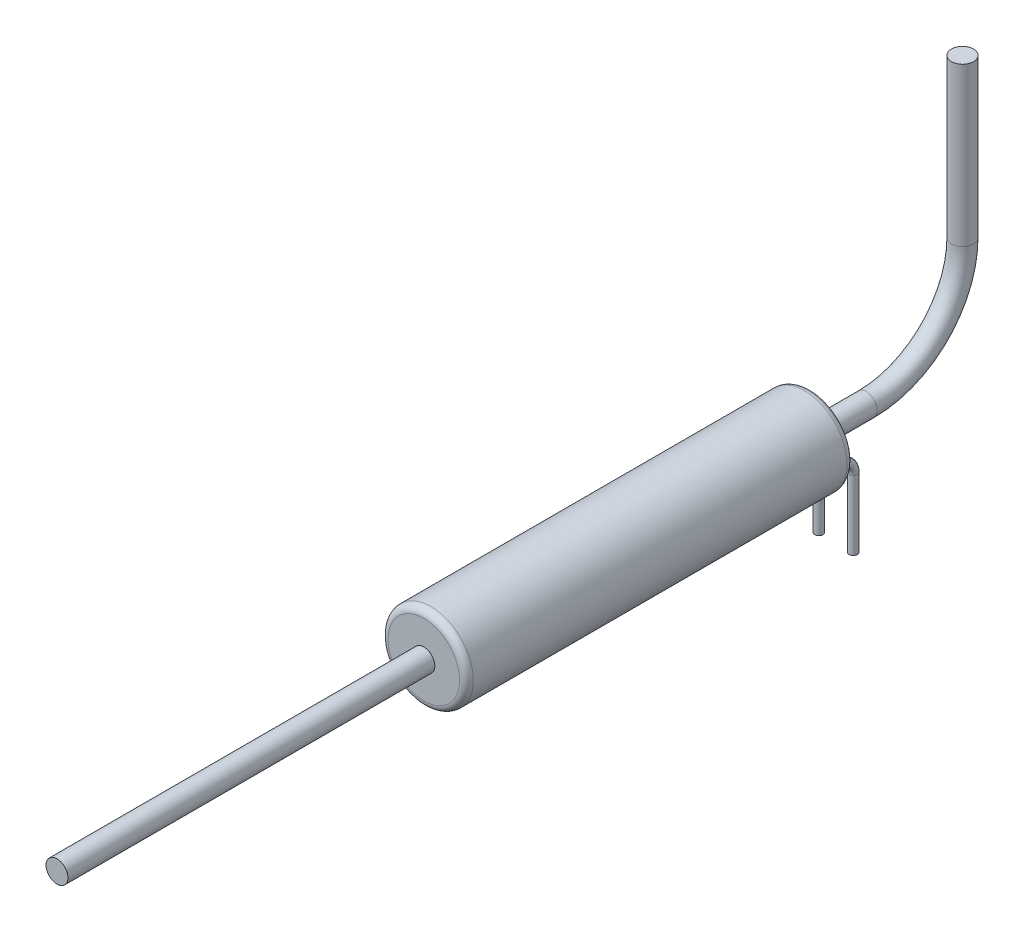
ISO-10303-21;
HEADER;
FILE_DESCRIPTION(('STEP AP214'),'2;1');
FILE_NAME('part.step','',(''),(''),'','','');
FILE_SCHEMA(('AUTOMOTIVE_DESIGN { 1 0 10303 214 1 1 1 1 }'));
ENDSEC;
DATA;
#1=APPLICATION_CONTEXT('core data for automotive mechanical design processes');
#2=APPLICATION_PROTOCOL_DEFINITION('international standard','automotive_design',2000,#1);
#3=PRODUCT_CONTEXT('',#1,'mechanical');
#4=PRODUCT('Part','Part','',(#3));
#5=PRODUCT_RELATED_PRODUCT_CATEGORY('part','',(#4));
#6=PRODUCT_DEFINITION_FORMATION('','',#4);
#7=PRODUCT_DEFINITION_CONTEXT('part definition',#1,'design');
#8=PRODUCT_DEFINITION('design','',#6,#7);
#9=PRODUCT_DEFINITION_SHAPE('','',#8);
#10=(LENGTH_UNIT() NAMED_UNIT(*) SI_UNIT(.MILLI.,.METRE.));
#11=(NAMED_UNIT(*) PLANE_ANGLE_UNIT() SI_UNIT($,.RADIAN.));
#12=(NAMED_UNIT(*) SI_UNIT($,.STERADIAN.) SOLID_ANGLE_UNIT());
#13=UNCERTAINTY_MEASURE_WITH_UNIT(LENGTH_MEASURE(1.E-05),#10,'distance_accuracy_value','');
#14=(GEOMETRIC_REPRESENTATION_CONTEXT(3) GLOBAL_UNCERTAINTY_ASSIGNED_CONTEXT((#13)) GLOBAL_UNIT_ASSIGNED_CONTEXT((#10,
#11,#12)) REPRESENTATION_CONTEXT('',''));
#15=CARTESIAN_POINT('',(0.,0.,0.));
#16=DIRECTION('',(0.,0.,1.));
#17=DIRECTION('',(1.,0.,0.));
#18=AXIS2_PLACEMENT_3D('',#15,#16,#17);
#19=CARTESIAN_POINT('',(0.,0.,28.2));
#20=DIRECTION('',(0.,0.,1.));
#21=DIRECTION('',(1.,0.,0.));
#22=AXIS2_PLACEMENT_3D('',#19,#20,#21);
#23=PLANE('',#22);
#24=CARTESIAN_POINT('',(0.,0.,28.2));
#25=DIRECTION('',(0.,0.,1.));
#26=DIRECTION('',(1.,0.,0.));
#27=AXIS2_PLACEMENT_3D('',#24,#25,#26);
#28=CIRCLE('',#27,2.6);
#29=CARTESIAN_POINT('',(2.6,0.,28.2));
#30=VERTEX_POINT('',#29);
#31=EDGE_CURVE('E12',#30,#30,#28,.T.);
#32=ORIENTED_EDGE('',*,*,#31,.T.);
#33=EDGE_LOOP('',(#32));
#34=FACE_BOUND('',#33,.T.);
#35=CARTESIAN_POINT('',(0.,0.,28.2));
#36=DIRECTION('',(0.,0.,1.));
#37=DIRECTION('',(1.,0.,0.));
#38=AXIS2_PLACEMENT_3D('',#35,#36,#37);
#39=CIRCLE('',#38,0.8);
#40=CARTESIAN_POINT('',(0.8,0.,28.2));
#41=VERTEX_POINT('',#40);
#42=EDGE_CURVE('E210',#41,#41,#39,.T.);
#43=ORIENTED_EDGE('',*,*,#42,.F.);
#44=EDGE_LOOP('',(#43));
#45=FACE_BOUND('',#44,.T.);
#46=ADVANCED_FACE('F46',(#34,#45),#23,.T.);
#47=CARTESIAN_POINT('',(0.,0.,0.));
#48=DIRECTION('',(0.,0.,1.));
#49=DIRECTION('',(1.,0.,0.));
#50=AXIS2_PLACEMENT_3D('',#47,#48,#49);
#51=PLANE('',#50);
#52=CARTESIAN_POINT('',(0.,0.,0.));
#53=DIRECTION('',(0.,0.,1.));
#54=DIRECTION('',(1.,0.,0.));
#55=AXIS2_PLACEMENT_3D('',#52,#53,#54);
#56=CIRCLE('',#55,2.6);
#57=CARTESIAN_POINT('',(2.6,0.,0.));
#58=VERTEX_POINT('',#57);
#59=EDGE_CURVE('E61',#58,#58,#56,.F.);
#60=ORIENTED_EDGE('',*,*,#59,.T.);
#61=EDGE_LOOP('',(#60));
#62=FACE_BOUND('',#61,.T.);
#63=CARTESIAN_POINT('',(-1.25,-1.55,0.));
#64=DIRECTION('',(0.,0.,1.));
#65=DIRECTION('',(1.,0.,0.));
#66=AXIS2_PLACEMENT_3D('',#63,#64,#65);
#67=CIRCLE('',#66,0.3);
#68=CARTESIAN_POINT('',(-0.95,-1.55,0.));
#69=VERTEX_POINT('',#68);
#70=EDGE_CURVE('E116',#69,#69,#67,.F.);
#71=ORIENTED_EDGE('',*,*,#70,.F.);
#72=EDGE_LOOP('',(#71));
#73=FACE_BOUND('',#72,.T.);
#74=CARTESIAN_POINT('',(1.25,-1.55,0.));
#75=DIRECTION('',(0.,0.,-1.));
#76=DIRECTION('',(-1.,0.,0.));
#77=AXIS2_PLACEMENT_3D('',#74,#75,#76);
#78=CIRCLE('',#77,0.3);
#79=CARTESIAN_POINT('',(0.95,-1.55,0.));
#80=VERTEX_POINT('',#79);
#81=EDGE_CURVE('E120',#80,#80,#78,.T.);
#82=ORIENTED_EDGE('',*,*,#81,.F.);
#83=EDGE_LOOP('',(#82));
#84=FACE_BOUND('',#83,.T.);
#85=CARTESIAN_POINT('',(0.,0.,0.));
#86=DIRECTION('',(0.,0.,-1.));
#87=DIRECTION('',(0.,1.,0.));
#88=AXIS2_PLACEMENT_3D('',#85,#86,#87);
#89=CIRCLE('',#88,0.8);
#90=CARTESIAN_POINT('',(0.,0.8,0.));
#91=VERTEX_POINT('',#90);
#92=EDGE_CURVE('E66',#91,#91,#89,.T.);
#93=ORIENTED_EDGE('',*,*,#92,.F.);
#94=EDGE_LOOP('',(#93));
#95=FACE_BOUND('',#94,.T.);
#96=ADVANCED_FACE('F91',(#62,#73,#84,#95),#51,.F.);
#97=CARTESIAN_POINT('',(0.,0.,0.));
#98=DIRECTION('',(0.,0.,1.));
#99=DIRECTION('',(1.,0.,0.));
#100=AXIS2_PLACEMENT_3D('',#97,#98,#99);
#101=CYLINDRICAL_SURFACE('',#100,3.1);
#102=CARTESIAN_POINT('',(0.,0.,0.5));
#103=DIRECTION('',(0.,0.,1.));
#104=DIRECTION('',(1.,0.,0.));
#105=AXIS2_PLACEMENT_3D('',#102,#103,#104);
#106=CIRCLE('',#105,3.1);
#107=CARTESIAN_POINT('',(3.1,0.,0.5));
#108=VERTEX_POINT('',#107);
#109=EDGE_CURVE('E53',#108,#108,#106,.T.);
#110=ORIENTED_EDGE('',*,*,#109,.T.);
#111=EDGE_LOOP('',(#110));
#112=FACE_BOUND('',#111,.T.);
#113=CARTESIAN_POINT('',(0.,0.,27.7));
#114=DIRECTION('',(0.,0.,1.));
#115=DIRECTION('',(1.,0.,0.));
#116=AXIS2_PLACEMENT_3D('',#113,#114,#115);
#117=CIRCLE('',#116,3.1);
#118=CARTESIAN_POINT('',(3.1,0.,27.7));
#119=VERTEX_POINT('',#118);
#120=EDGE_CURVE('E57',#119,#119,#117,.F.);
#121=ORIENTED_EDGE('',*,*,#120,.T.);
#122=EDGE_LOOP('',(#121));
#123=FACE_BOUND('',#122,.T.);
#124=ADVANCED_FACE('F89',(#112,#123),#101,.T.);
#125=CARTESIAN_POINT('',(0.,0.,0.));
#126=DIRECTION('',(0.,0.,-1.));
#127=DIRECTION('',(0.,1.,0.));
#128=AXIS2_PLACEMENT_3D('',#125,#126,#127);
#129=CYLINDRICAL_SURFACE('',#128,0.8);
#130=ORIENTED_EDGE('',*,*,#92,.T.);
#131=EDGE_LOOP('',(#130));
#132=FACE_BOUND('',#131,.T.);
#133=CARTESIAN_POINT('',(0.,0.,-4.));
#134=DIRECTION('',(0.,0.,-1.));
#135=DIRECTION('',(0.,-1.,0.));
#136=AXIS2_PLACEMENT_3D('',#133,#134,#135);
#137=CIRCLE('',#136,0.8);
#138=CARTESIAN_POINT('',(0.,-0.799999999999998,-4.));
#139=VERTEX_POINT('',#138);
#140=EDGE_CURVE('E70',#139,#139,#137,.T.);
#141=ORIENTED_EDGE('',*,*,#140,.F.);
#142=EDGE_LOOP('',(#141));
#143=FACE_BOUND('',#142,.T.);
#144=ADVANCED_FACE('F84',(#132,#143),#129,.T.);
#145=CARTESIAN_POINT('',(0.,7.,-4.));
#146=DIRECTION('',(1.,0.,0.));
#147=DIRECTION('',(0.,0.,-1.));
#148=AXIS2_PLACEMENT_3D('',#145,#146,#147);
#149=TOROIDAL_SURFACE('',#148,7.,0.8);
#150=ORIENTED_EDGE('',*,*,#140,.T.);
#151=EDGE_LOOP('',(#150));
#152=FACE_BOUND('',#151,.T.);
#153=CARTESIAN_POINT('',(0.,7.,-11.));
#154=DIRECTION('',(0.,-1.,0.));
#155=DIRECTION('',(0.,0.,-1.));
#156=AXIS2_PLACEMENT_3D('',#153,#154,#155);
#157=CIRCLE('',#156,0.8);
#158=CARTESIAN_POINT('',(0.,7.,-11.8));
#159=VERTEX_POINT('',#158);
#160=EDGE_CURVE('E74',#159,#159,#157,.F.);
#161=ORIENTED_EDGE('',*,*,#160,.F.);
#162=EDGE_LOOP('',(#161));
#163=FACE_BOUND('',#162,.T.);
#164=ADVANCED_FACE('F79',(#152,#163),#149,.T.);
#165=CARTESIAN_POINT('',(1.25,-1.55,0.));
#166=DIRECTION('',(0.,0.,-1.));
#167=DIRECTION('',(-1.,0.,0.));
#168=AXIS2_PLACEMENT_3D('',#165,#166,#167);
#169=CYLINDRICAL_SURFACE('',#168,0.3);
#170=ORIENTED_EDGE('',*,*,#81,.T.);
#171=EDGE_LOOP('',(#170));
#172=FACE_BOUND('',#171,.T.);
#173=CARTESIAN_POINT('',(1.25,-1.55,-0.8));
#174=DIRECTION('',(0.,0.,-1.));
#175=DIRECTION('',(0.,1.,0.));
#176=AXIS2_PLACEMENT_3D('',#173,#174,#175);
#177=CIRCLE('',#176,0.3);
#178=CARTESIAN_POINT('',(1.25,-1.25,-0.8));
#179=VERTEX_POINT('',#178);
#180=EDGE_CURVE('E132',#179,#179,#177,.T.);
#181=ORIENTED_EDGE('',*,*,#180,.F.);
#182=EDGE_LOOP('',(#181));
#183=FACE_BOUND('',#182,.T.);
#184=ADVANCED_FACE('F83',(#172,#183),#169,.T.);
#185=CARTESIAN_POINT('',(1.25,-2.55,-0.8));
#186=DIRECTION('',(-1.,0.,0.));
#187=DIRECTION('',(0.,0.,1.));
#188=AXIS2_PLACEMENT_3D('',#185,#186,#187);
#189=TOROIDAL_SURFACE('',#188,1.,0.3);
#190=ORIENTED_EDGE('',*,*,#180,.T.);
#191=EDGE_LOOP('',(#190));
#192=FACE_BOUND('',#191,.T.);
#193=CARTESIAN_POINT('',(1.25,-2.55,-1.8));
#194=DIRECTION('',(0.,1.,0.));
#195=DIRECTION('',(0.,0.,1.));
#196=AXIS2_PLACEMENT_3D('',#193,#194,#195);
#197=CIRCLE('',#196,0.3);
#198=CARTESIAN_POINT('',(1.25,-2.55,-1.5));
#199=VERTEX_POINT('',#198);
#200=EDGE_CURVE('E138',#199,#199,#197,.F.);
#201=ORIENTED_EDGE('',*,*,#200,.F.);
#202=EDGE_LOOP('',(#201));
#203=FACE_BOUND('',#202,.T.);
#204=ADVANCED_FACE('F144',(#192,#203),#189,.T.);
#205=CARTESIAN_POINT('',(-1.25,-1.55,0.));
#206=DIRECTION('',(0.,0.,1.));
#207=DIRECTION('',(1.,0.,0.));
#208=AXIS2_PLACEMENT_3D('',#205,#206,#207);
#209=CYLINDRICAL_SURFACE('',#208,0.3);
#210=ORIENTED_EDGE('',*,*,#70,.T.);
#211=EDGE_LOOP('',(#210));
#212=FACE_BOUND('',#211,.T.);
#213=CARTESIAN_POINT('',(-1.25,-1.55,-0.8));
#214=DIRECTION('',(0.,0.,1.));
#215=DIRECTION('',(0.,1.,0.));
#216=AXIS2_PLACEMENT_3D('',#213,#214,#215);
#217=CIRCLE('',#216,0.3);
#218=CARTESIAN_POINT('',(-1.25,-1.25,-0.8));
#219=VERTEX_POINT('',#218);
#220=EDGE_CURVE('E164',#219,#219,#217,.F.);
#221=ORIENTED_EDGE('',*,*,#220,.F.);
#222=EDGE_LOOP('',(#221));
#223=FACE_BOUND('',#222,.T.);
#224=ADVANCED_FACE('F147',(#212,#223),#209,.T.);
#225=CARTESIAN_POINT('',(-1.25,-2.55,-0.8));
#226=DIRECTION('',(1.,0.,0.));
#227=DIRECTION('',(0.,0.,1.));
#228=AXIS2_PLACEMENT_3D('',#225,#226,#227);
#229=TOROIDAL_SURFACE('',#228,1.,0.3);
#230=ORIENTED_EDGE('',*,*,#220,.T.);
#231=EDGE_LOOP('',(#230));
#232=FACE_BOUND('',#231,.T.);
#233=CARTESIAN_POINT('',(-1.25,-2.55,-1.8));
#234=DIRECTION('',(0.,1.,0.));
#235=DIRECTION('',(0.,0.,1.));
#236=AXIS2_PLACEMENT_3D('',#233,#234,#235);
#237=CIRCLE('',#236,0.3);
#238=CARTESIAN_POINT('',(-1.25,-2.55,-1.5));
#239=VERTEX_POINT('',#238);
#240=EDGE_CURVE('E162',#239,#239,#237,.F.);
#241=ORIENTED_EDGE('',*,*,#240,.F.);
#242=EDGE_LOOP('',(#241));
#243=FACE_BOUND('',#242,.T.);
#244=ADVANCED_FACE('F151',(#232,#243),#229,.T.);
#245=CARTESIAN_POINT('',(0.,18.49,-11.));
#246=DIRECTION('',(0.,-1.,0.));
#247=DIRECTION('',(0.,0.,-1.));
#248=AXIS2_PLACEMENT_3D('',#245,#246,#247);
#249=CYLINDRICAL_SURFACE('',#248,0.8);
#250=CARTESIAN_POINT('',(0.,18.49,-11.));
#251=DIRECTION('',(0.,1.,0.));
#252=DIRECTION('',(0.,0.,1.));
#253=AXIS2_PLACEMENT_3D('',#250,#251,#252);
#254=CIRCLE('',#253,0.8);
#255=CARTESIAN_POINT('',(0.,18.49,-10.2));
#256=VERTEX_POINT('',#255);
#257=EDGE_CURVE('E220',#256,#256,#254,.T.);
#258=ORIENTED_EDGE('',*,*,#257,.F.);
#259=EDGE_LOOP('',(#258));
#260=FACE_BOUND('',#259,.T.);
#261=ORIENTED_EDGE('',*,*,#160,.T.);
#262=EDGE_LOOP('',(#261));
#263=FACE_BOUND('',#262,.T.);
#264=ADVANCED_FACE('F156',(#260,#263),#249,.T.);
#265=CARTESIAN_POINT('',(0.,18.49,-11.));
#266=DIRECTION('',(0.,1.,0.));
#267=DIRECTION('',(0.,0.,1.));
#268=AXIS2_PLACEMENT_3D('',#265,#266,#267);
#269=PLANE('',#268);
#270=ORIENTED_EDGE('',*,*,#257,.T.);
#271=EDGE_LOOP('',(#270));
#272=FACE_BOUND('',#271,.T.);
#273=ADVANCED_FACE('F180',(#272),#269,.T.);
#274=CARTESIAN_POINT('',(1.25,-7.6,-1.8));
#275=DIRECTION('',(0.,1.,0.));
#276=DIRECTION('',(0.,0.,1.));
#277=AXIS2_PLACEMENT_3D('',#274,#275,#276);
#278=CYLINDRICAL_SURFACE('',#277,0.3);
#279=CARTESIAN_POINT('',(1.25,-7.6,-1.8));
#280=DIRECTION('',(0.,-1.,0.));
#281=DIRECTION('',(0.,0.,-1.));
#282=AXIS2_PLACEMENT_3D('',#279,#280,#281);
#283=CIRCLE('',#282,0.3);
#284=CARTESIAN_POINT('',(1.25,-7.6,-2.1));
#285=VERTEX_POINT('',#284);
#286=EDGE_CURVE('E218',#285,#285,#283,.T.);
#287=ORIENTED_EDGE('',*,*,#286,.F.);
#288=EDGE_LOOP('',(#287));
#289=FACE_BOUND('',#288,.T.);
#290=ORIENTED_EDGE('',*,*,#200,.T.);
#291=EDGE_LOOP('',(#290));
#292=FACE_BOUND('',#291,.T.);
#293=ADVANCED_FACE('F176',(#289,#292),#278,.T.);
#294=CARTESIAN_POINT('',(1.25,-7.6,-1.8));
#295=DIRECTION('',(0.,-1.,0.));
#296=DIRECTION('',(0.,0.,-1.));
#297=AXIS2_PLACEMENT_3D('',#294,#295,#296);
#298=PLANE('',#297);
#299=ORIENTED_EDGE('',*,*,#286,.T.);
#300=EDGE_LOOP('',(#299));
#301=FACE_BOUND('',#300,.T.);
#302=ADVANCED_FACE('F179',(#301),#298,.T.);
#303=CARTESIAN_POINT('',(-1.25,-7.6,-1.8));
#304=DIRECTION('',(0.,1.,0.));
#305=DIRECTION('',(0.,0.,1.));
#306=AXIS2_PLACEMENT_3D('',#303,#304,#305);
#307=CYLINDRICAL_SURFACE('',#306,0.3);
#308=CARTESIAN_POINT('',(-1.25,-7.6,-1.8));
#309=DIRECTION('',(0.,-1.,0.));
#310=DIRECTION('',(0.,0.,-1.));
#311=AXIS2_PLACEMENT_3D('',#308,#309,#310);
#312=CIRCLE('',#311,0.3);
#313=CARTESIAN_POINT('',(-1.25,-7.6,-2.1));
#314=VERTEX_POINT('',#313);
#315=EDGE_CURVE('E213',#314,#314,#312,.T.);
#316=ORIENTED_EDGE('',*,*,#315,.F.);
#317=EDGE_LOOP('',(#316));
#318=FACE_BOUND('',#317,.T.);
#319=ORIENTED_EDGE('',*,*,#240,.T.);
#320=EDGE_LOOP('',(#319));
#321=FACE_BOUND('',#320,.T.);
#322=ADVANCED_FACE('F187',(#318,#321),#307,.T.);
#323=CARTESIAN_POINT('',(-1.25,-7.6,-1.8));
#324=DIRECTION('',(0.,-1.,0.));
#325=DIRECTION('',(0.,0.,-1.));
#326=AXIS2_PLACEMENT_3D('',#323,#324,#325);
#327=PLANE('',#326);
#328=ORIENTED_EDGE('',*,*,#315,.T.);
#329=EDGE_LOOP('',(#328));
#330=FACE_BOUND('',#329,.T.);
#331=ADVANCED_FACE('F195',(#330),#327,.T.);
#332=CARTESIAN_POINT('',(0.,0.,54.9));
#333=DIRECTION('',(0.,0.,-1.));
#334=DIRECTION('',(-1.,0.,0.));
#335=AXIS2_PLACEMENT_3D('',#332,#333,#334);
#336=CYLINDRICAL_SURFACE('',#335,0.8);
#337=CARTESIAN_POINT('',(0.,0.,54.9));
#338=DIRECTION('',(0.,0.,1.));
#339=DIRECTION('',(1.,0.,0.));
#340=AXIS2_PLACEMENT_3D('',#337,#338,#339);
#341=CIRCLE('',#340,0.8);
#342=CARTESIAN_POINT('',(0.8,0.,54.9));
#343=VERTEX_POINT('',#342);
#344=EDGE_CURVE('E207',#343,#343,#341,.T.);
#345=ORIENTED_EDGE('',*,*,#344,.F.);
#346=EDGE_LOOP('',(#345));
#347=FACE_BOUND('',#346,.T.);
#348=ORIENTED_EDGE('',*,*,#42,.T.);
#349=EDGE_LOOP('',(#348));
#350=FACE_BOUND('',#349,.T.);
#351=ADVANCED_FACE('F107',(#347,#350),#336,.T.);
#352=CARTESIAN_POINT('',(0.,0.,54.9));
#353=DIRECTION('',(0.,0.,1.));
#354=DIRECTION('',(1.,0.,0.));
#355=AXIS2_PLACEMENT_3D('',#352,#353,#354);
#356=PLANE('',#355);
#357=ORIENTED_EDGE('',*,*,#344,.T.);
#358=EDGE_LOOP('',(#357));
#359=FACE_BOUND('',#358,.T.);
#360=ADVANCED_FACE('F100',(#359),#356,.T.);
#361=CARTESIAN_POINT('',(0.,0.,0.5));
#362=DIRECTION('',(0.,0.,1.));
#363=DIRECTION('',(1.,0.,0.));
#364=AXIS2_PLACEMENT_3D('',#361,#362,#363);
#365=TOROIDAL_SURFACE('',#364,2.6,0.5);
#366=ORIENTED_EDGE('',*,*,#109,.F.);
#367=EDGE_LOOP('',(#366));
#368=FACE_BOUND('',#367,.T.);
#369=ORIENTED_EDGE('',*,*,#59,.F.);
#370=EDGE_LOOP('',(#369));
#371=FACE_BOUND('',#370,.T.);
#372=ADVANCED_FACE('F98',(#368,#371),#365,.T.);
#373=CARTESIAN_POINT('',(0.,0.,27.7));
#374=DIRECTION('',(0.,0.,1.));
#375=DIRECTION('',(1.,0.,0.));
#376=AXIS2_PLACEMENT_3D('',#373,#374,#375);
#377=TOROIDAL_SURFACE('',#376,2.6,0.5);
#378=ORIENTED_EDGE('',*,*,#120,.F.);
#379=EDGE_LOOP('',(#378));
#380=FACE_BOUND('',#379,.T.);
#381=ORIENTED_EDGE('',*,*,#31,.F.);
#382=EDGE_LOOP('',(#381));
#383=FACE_BOUND('',#382,.T.);
#384=ADVANCED_FACE('F48',(#380,#383),#377,.T.);
#385=CLOSED_SHELL('',(#46,#96,#124,#144,#164,#184,#204,#224,#244,#264,#273,#293,#302,#322,#331,
#351,#360,#372,#384));
#386=MANIFOLD_SOLID_BREP('B2',#385);
#387=ADVANCED_BREP_SHAPE_REPRESENTATION('',(#18,#386),#14);
#388=SHAPE_DEFINITION_REPRESENTATION(#9,#387);
ENDSEC;
END-ISO-10303-21;
